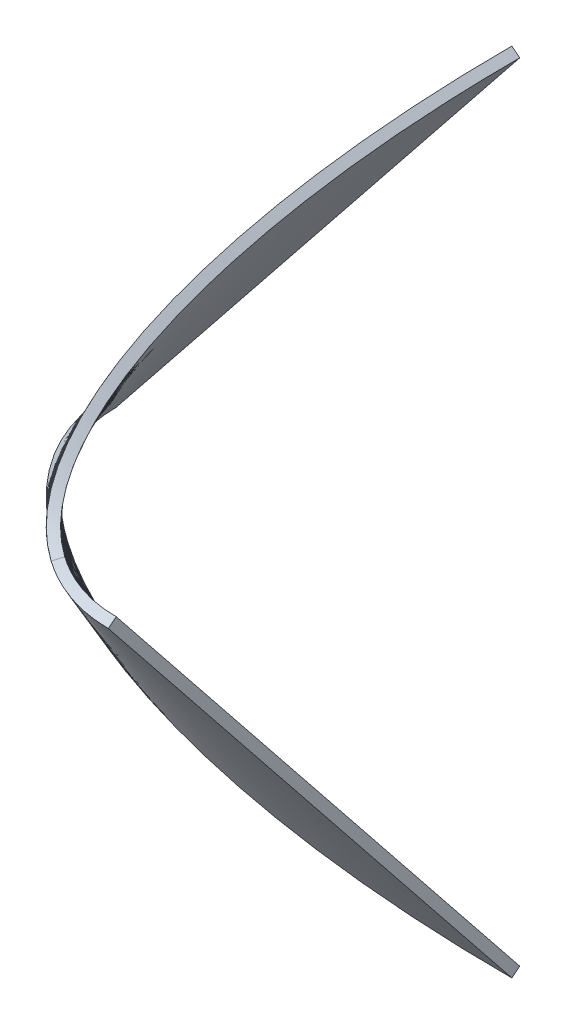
ISO-10303-21;
HEADER;
FILE_DESCRIPTION(('STEP AP214'),'2;1');
FILE_NAME('part.step','',(''),(''),'','','');
FILE_SCHEMA(('AUTOMOTIVE_DESIGN { 1 0 10303 214 1 1 1 1 }'));
ENDSEC;
DATA;
#1=APPLICATION_CONTEXT('core data for automotive mechanical design processes');
#2=APPLICATION_PROTOCOL_DEFINITION('international standard','automotive_design',2000,#1);
#3=PRODUCT_CONTEXT('',#1,'mechanical');
#4=PRODUCT('Part','Part','',(#3));
#5=PRODUCT_RELATED_PRODUCT_CATEGORY('part','',(#4));
#6=PRODUCT_DEFINITION_FORMATION('','',#4);
#7=PRODUCT_DEFINITION_CONTEXT('part definition',#1,'design');
#8=PRODUCT_DEFINITION('design','',#6,#7);
#9=PRODUCT_DEFINITION_SHAPE('','',#8);
#10=(LENGTH_UNIT() NAMED_UNIT(*) SI_UNIT(.MILLI.,.METRE.));
#11=(NAMED_UNIT(*) PLANE_ANGLE_UNIT() SI_UNIT($,.RADIAN.));
#12=(NAMED_UNIT(*) SI_UNIT($,.STERADIAN.) SOLID_ANGLE_UNIT());
#13=UNCERTAINTY_MEASURE_WITH_UNIT(LENGTH_MEASURE(1.E-05),#10,'distance_accuracy_value','');
#14=(GEOMETRIC_REPRESENTATION_CONTEXT(3) GLOBAL_UNCERTAINTY_ASSIGNED_CONTEXT((#13)) GLOBAL_UNIT_ASSIGNED_CONTEXT((#10,
#11,#12)) REPRESENTATION_CONTEXT('',''));
#15=CARTESIAN_POINT('',(0.,0.,0.));
#16=DIRECTION('',(0.,0.,1.));
#17=DIRECTION('',(1.,0.,0.));
#18=AXIS2_PLACEMENT_3D('',#15,#16,#17);
#19=CARTESIAN_POINT('',(-30.,50.,0.));
#20=DIRECTION('',(0.,0.,-1.));
#21=DIRECTION('',(0.780868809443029,-0.624695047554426,0.));
#22=AXIS2_PLACEMENT_3D('',#19,#20,#21);
#23=PLANE('',#22);
#24=CARTESIAN_POINT('',(-29.219131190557,49.3753049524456,0.));
#25=CARTESIAN_POINT('',(-30.,50.,0.));
#26=B_SPLINE_CURVE_WITH_KNOTS('',1,(#24,#25),.UNSPECIFIED.,.F.,.F.,(2,2),(0.,1.),.UNSPECIFIED.);
#27=CARTESIAN_POINT('',(-29.219131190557,49.3753049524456,0.));
#28=VERTEX_POINT('',#27);
#29=CARTESIAN_POINT('',(-30.,50.,0.));
#30=VERTEX_POINT('',#29);
#31=EDGE_CURVE('E14',#28,#30,#26,.T.);
#32=ORIENTED_EDGE('',*,*,#31,.F.);
#33=CARTESIAN_POINT('',(-69.2191311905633,-0.624695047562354,0.));
#34=CARTESIAN_POINT('',(-67.5524645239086,1.458638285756,-2.91055878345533E-10));
#35=CARTESIAN_POINT('',(-65.8857978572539,3.54197161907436,-3.03260839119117E-10));
#36=CARTESIAN_POINT('',(-62.5524645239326,7.70863828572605,-1.49265427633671E-10));
#37=CARTESIAN_POINT('',(-60.8857978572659,9.79197161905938,1.6934944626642E-11));
#38=CARTESIAN_POINT('',(-57.5524645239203,13.9586382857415,1.48427375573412E-10));
#39=CARTESIAN_POINT('',(-55.8857978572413,16.0419716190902,1.13719434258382E-10));
#40=CARTESIAN_POINT('',(-52.5524645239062,20.2086382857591,1.65645079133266E-11));
#41=CARTESIAN_POINT('',(-50.8857978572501,22.2919716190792,-4.5882477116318E-11));
#42=CARTESIAN_POINT('',(-47.5524645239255,26.4586382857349,-6.16065027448E-11));
#43=CARTESIAN_POINT('',(-45.8857978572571,28.5419716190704,-1.48835433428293E-11));
#44=CARTESIAN_POINT('',(-42.5524645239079,32.7086382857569,1.4873899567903E-11));
#45=CARTESIAN_POINT('',(-40.8857978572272,34.7919716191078,-2.09161692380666E-12));
#46=CARTESIAN_POINT('',(-37.5524645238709,38.9586382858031,2.07661549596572E-12));
#47=CARTESIAN_POINT('',(-35.8857978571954,41.0419716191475,2.32103644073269E-11));
#48=CARTESIAN_POINT('',(-32.5524645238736,45.2086382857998,4.72524535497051E-11));
#49=CARTESIAN_POINT('',(-30.8857978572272,47.2919716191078,5.01607937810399E-11));
#50=CARTESIAN_POINT('',(-29.2191311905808,49.3753049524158,1.57940926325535E-11));
#51=B_SPLINE_CURVE_WITH_KNOTS('',3,(#33,#34,#35,#36,#37,#38,#39,#40,#41,#42,#43,#44,#45,#46,#47,
#48,#49,#50),.UNSPECIFIED.,.F.,.F.,(4,2,2,2,2,2,2,2,4),(0.,8.00390529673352,16.0078105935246,
24.0117158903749,32.0156211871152,40.0195264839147,48.0234317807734,56.0273370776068,
64.0312423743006),.UNSPECIFIED.);
#52=CARTESIAN_POINT('',(-69.219131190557,-0.624695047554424,0.));
#53=VERTEX_POINT('',#52);
#54=EDGE_CURVE('E160',#28,#53,#51,.F.);
#55=ORIENTED_EDGE('',*,*,#54,.T.);
#56=CARTESIAN_POINT('',(-70.,0.,0.));
#57=CARTESIAN_POINT('',(-69.219131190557,-0.624695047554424,0.));
#58=B_SPLINE_CURVE_WITH_KNOTS('',1,(#56,#57),.UNSPECIFIED.,.F.,.F.,(2,2),(0.,1.),.UNSPECIFIED.);
#59=CARTESIAN_POINT('',(-70.,0.,0.));
#60=VERTEX_POINT('',#59);
#61=EDGE_CURVE('E119',#53,#60,#58,.F.);
#62=ORIENTED_EDGE('',*,*,#61,.T.);
#63=CARTESIAN_POINT('',(-30.,50.,0.));
#64=CARTESIAN_POINT('',(-70.,0.,0.));
#65=B_SPLINE_CURVE_WITH_KNOTS('',1,(#63,#64),.UNSPECIFIED.,.F.,.F.,(2,2),(0.,1.),.UNSPECIFIED.);
#66=EDGE_CURVE('E163',#30,#60,#65,.T.);
#67=ORIENTED_EDGE('',*,*,#66,.F.);
#68=EDGE_LOOP('',(#32,#55,#62,#67));
#69=FACE_BOUND('',#68,.T.);
#70=ADVANCED_FACE('F107',(#69),#23,.T.);
#71=CARTESIAN_POINT('',(-59.7044158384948,0.,15.6612381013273));
#72=CARTESIAN_POINT('',(-60.4888896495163,0.,15.111943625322));
#73=CARTESIAN_POINT('',(-61.0596221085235,0.,14.6779794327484));
#74=CARTESIAN_POINT('',(-62.080263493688,0.,13.867225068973));
#75=CARTESIAN_POINT('',(-62.5301724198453,0.,13.4904348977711));
#76=CARTESIAN_POINT('',(-63.3451650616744,0.,12.7737515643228));
#77=CARTESIAN_POINT('',(-63.7102487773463,0.,12.4338584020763));
#78=CARTESIAN_POINT('',(-64.3929645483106,0.,11.7695858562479));
#79=CARTESIAN_POINT('',(-64.7105966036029,0.,11.4452064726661));
#80=CARTESIAN_POINT('',(-65.3046055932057,0.,10.8081184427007));
#81=CARTESIAN_POINT('',(-65.5809825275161,0.,10.4954097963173));
#82=CARTESIAN_POINT('',(-66.1031180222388,0.,9.87519194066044));
#83=CARTESIAN_POINT('',(-66.348876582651,0.,9.56768273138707));
#84=CARTESIAN_POINT('',(-67.0440158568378,0.,8.65006665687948));
#85=CARTESIAN_POINT('',(-67.4524452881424,0.,8.04419907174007));
#86=CARTESIAN_POINT('',(-68.1776116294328,0.,6.82974414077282));
#87=CARTESIAN_POINT('',(-68.4935819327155,0.,6.22156521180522));
#88=CARTESIAN_POINT('',(-69.0373891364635,0.,4.99714063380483));
#89=CARTESIAN_POINT('',(-69.2649292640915,0.,4.3810591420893));
#90=CARTESIAN_POINT('',(-69.8136949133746,0.,2.51967204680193));
#91=CARTESIAN_POINT('',(-70.,0.,1.26099894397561));
#92=CARTESIAN_POINT('',(-70.,0.,0.));
#93=CARTESIAN_POINT('',(-59.1487392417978,0.247872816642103,14.8676496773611));
#94=CARTESIAN_POINT('',(-59.9144584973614,0.222464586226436,14.323551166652));
#95=CARTESIAN_POINT('',(-60.4605169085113,0.187718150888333,13.8991378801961));
#96=CARTESIAN_POINT('',(-61.4524521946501,0.14254704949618,13.1015275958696));
#97=CARTESIAN_POINT('',(-61.8870946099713,0.116812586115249,12.7329191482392));
#98=CARTESIAN_POINT('',(-62.6728776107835,0.063200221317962,12.0354699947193));
#99=CARTESIAN_POINT('',(-63.0241322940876,0.0354490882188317,11.706642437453));
#100=CARTESIAN_POINT('',(-63.6844397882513,-0.0143109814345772,11.0634389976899));
#101=CARTESIAN_POINT('',(-63.9910986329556,-0.0407350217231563,10.751166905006));
#102=CARTESIAN_POINT('',(-64.5646717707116,-0.0950093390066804,10.1414110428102));
#103=CARTESIAN_POINT('',(-64.8319557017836,-0.122086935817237,9.84349423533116));
#104=CARTESIAN_POINT('',(-65.3389305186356,-0.173430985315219,9.25319559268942));
#105=CARTESIAN_POINT('',(-65.577933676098,-0.19938586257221,8.96197866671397));
#106=CARTESIAN_POINT('',(-66.2558645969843,-0.275977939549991,8.09635718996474));
#107=CARTESIAN_POINT('',(-66.6574146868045,-0.323732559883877,7.5278805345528));
#108=CARTESIAN_POINT('',(-67.3754435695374,-0.410705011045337,6.39235523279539));
#109=CARTESIAN_POINT('',(-67.6912827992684,-0.449222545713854,5.82498944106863));
#110=CARTESIAN_POINT('',(-68.2382454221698,-0.514882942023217,4.68246299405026));
#111=CARTESIAN_POINT('',(-68.4690275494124,-0.541877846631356,4.10723509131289));
#112=CARTESIAN_POINT('',(-69.0274886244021,-0.605494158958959,2.3662461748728));
#113=CARTESIAN_POINT('',(-69.219131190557,-0.624695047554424,1.18462776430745));
#114=CARTESIAN_POINT('',(-69.219131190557,-0.624695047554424,0.));
#115=B_SPLINE_SURFACE_WITH_KNOTS('',1,3,((#71,#72,#73,#74,#75,#76,#77,#78,#79,#80,#81,#82,#83,
#84,#85,#86,#87,#88,#89,#90,#91,#92),(#93,#94,#95,#96,#97,#98,#99,#100,#101,#102,#103,#104,#105,
#106,#107,#108,#109,#110,#111,#112,#113,#114)),.UNSPECIFIED.,.F.,.F.,.F.,(2,2),(4,2,2,2,2,2,2,2,
2,2,4),(0.,1.),(0.,0.0625,0.125,0.1875,0.25,0.3125,0.375,0.5,0.625,0.75,1.),.UNSPECIFIED.);
#116=CARTESIAN_POINT('',(-69.219131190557,-0.624695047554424,0.));
#117=CARTESIAN_POINT('',(-69.219131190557,-0.624695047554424,1.18462776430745));
#118=CARTESIAN_POINT('',(-69.0274886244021,-0.605494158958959,2.3662461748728));
#119=CARTESIAN_POINT('',(-68.4690275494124,-0.541877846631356,4.10723509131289));
#120=CARTESIAN_POINT('',(-68.2382454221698,-0.514882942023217,4.68246299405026));
#121=CARTESIAN_POINT('',(-67.6912827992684,-0.449222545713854,5.82498944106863));
#122=CARTESIAN_POINT('',(-67.3754435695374,-0.410705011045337,6.39235523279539));
#123=CARTESIAN_POINT('',(-66.6574146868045,-0.323732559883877,7.5278805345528));
#124=CARTESIAN_POINT('',(-66.2558645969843,-0.275977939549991,8.09635718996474));
#125=CARTESIAN_POINT('',(-65.577933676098,-0.19938586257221,8.96197866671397));
#126=CARTESIAN_POINT('',(-65.3389305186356,-0.173430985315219,9.25319559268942));
#127=CARTESIAN_POINT('',(-64.8319557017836,-0.122086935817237,9.84349423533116));
#128=CARTESIAN_POINT('',(-64.5646717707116,-0.0950093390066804,10.1414110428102));
#129=CARTESIAN_POINT('',(-63.9910986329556,-0.0407350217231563,10.751166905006));
#130=CARTESIAN_POINT('',(-63.6844397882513,-0.0143109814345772,11.0634389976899));
#131=CARTESIAN_POINT('',(-63.0241322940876,0.0354490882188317,11.706642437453));
#132=CARTESIAN_POINT('',(-62.6728776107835,0.063200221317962,12.0354699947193));
#133=CARTESIAN_POINT('',(-61.8870946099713,0.116812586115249,12.7329191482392));
#134=CARTESIAN_POINT('',(-61.4524521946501,0.14254704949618,13.1015275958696));
#135=CARTESIAN_POINT('',(-60.4605169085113,0.187718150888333,13.8991378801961));
#136=CARTESIAN_POINT('',(-59.9144584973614,0.222464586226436,14.323551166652));
#137=CARTESIAN_POINT('',(-59.1487392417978,0.247872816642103,14.8676496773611));
#138=B_SPLINE_CURVE_WITH_KNOTS('',3,(#116,#117,#118,#119,#120,#121,#122,#123,#124,#125,#126,
#127,#128,#129,#130,#131,#132,#133,#134,#135,#136,#137),.UNSPECIFIED.,.F.,.F.,(4,2,2,2,2,2,2,2,
2,2,4),(0.,0.25,0.375,0.5,0.625,0.6875,0.75,0.8125,0.875,0.9375,1.),.UNSPECIFIED.);
#139=CARTESIAN_POINT('',(-59.1487392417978,0.247872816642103,14.8676496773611));
#140=VERTEX_POINT('',#139);
#141=EDGE_CURVE('E182',#53,#140,#138,.T.);
#142=CARTESIAN_POINT('',(-59.1487392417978,0.247872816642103,14.8676496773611));
#143=CARTESIAN_POINT('',(-59.7044158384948,0.,15.6612381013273));
#144=B_SPLINE_CURVE_WITH_KNOTS('',1,(#142,#143),.UNSPECIFIED.,.F.,.F.,(2,2),(0.,1.),.UNSPECIFIED.);
#145=CARTESIAN_POINT('',(-59.7044158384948,0.,15.6612381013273));
#146=VERTEX_POINT('',#145);
#147=EDGE_CURVE('E300',#140,#146,#144,.T.);
#148=CARTESIAN_POINT('',(-70.,0.,0.));
#149=CARTESIAN_POINT('',(-70.,0.,0.630217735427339));
#150=CARTESIAN_POINT('',(-69.9071368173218,0.,1.89064733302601));
#151=CARTESIAN_POINT('',(-69.5616820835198,0.,3.45250618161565));
#152=CARTESIAN_POINT('',(-69.1510983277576,0.,4.68914973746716));
#153=CARTESIAN_POINT('',(-68.7766068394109,0.,5.61029529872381));
#154=CARTESIAN_POINT('',(-68.3353875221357,0.,6.52578660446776));
#155=CARTESIAN_POINT('',(-67.8267863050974,0.,7.43714350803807));
#156=CARTESIAN_POINT('',(-67.2476380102,0.,8.34746900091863));
#157=CARTESIAN_POINT('',(-66.5946351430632,0.,9.26017352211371));
#158=CARTESIAN_POINT('',(-65.8573594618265,0.,10.1827011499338));
#159=CARTESIAN_POINT('',(-65.0282286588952,0.,11.1208270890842));
#160=CARTESIAN_POINT('',(-64.0753324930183,0.,12.0939652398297));
#161=CARTESIAN_POINT('',(-62.9800813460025,0.,13.1136447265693));
#162=CARTESIAN_POINT('',(-61.6303545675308,0.,14.2440152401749));
#163=CARTESIAN_POINT('',(-60.4888896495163,0.,15.111943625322));
#164=CARTESIAN_POINT('',(-59.7044158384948,0.,15.6612381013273));
#165=B_SPLINE_CURVE_WITH_KNOTS('',3,(#148,#149,#150,#151,#152,#153,#154,#155,#156,#157,#158,
#159,#160,#161,#162,#163,#164),.UNSPECIFIED.,.F.,.F.,(4,1,1,1,1,1,1,1,1,1,1,1,1,1,4),(0.,0.125,
0.25,0.3125,0.375,0.4375,0.5,0.5625,0.625,0.6875,0.75,0.8125,0.875,0.9375,1.),.UNSPECIFIED.);
#166=EDGE_CURVE('E327',#60,#146,#165,.T.);
#167=ORIENTED_EDGE('',*,*,#61,.F.);
#168=ORIENTED_EDGE('',*,*,#141,.T.);
#169=ORIENTED_EDGE('',*,*,#147,.T.);
#170=ORIENTED_EDGE('',*,*,#166,.F.);
#171=EDGE_LOOP('',(#167,#168,#169,#170));
#172=FACE_BOUND('',#171,.T.);
#173=ADVANCED_FACE('F218',(#172),#115,.F.);
#174=CARTESIAN_POINT('',(0.,0.,30.));
#175=CARTESIAN_POINT('',(-3.14476097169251,0.,30.));
#176=CARTESIAN_POINT('',(-6.53050049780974,0.,29.9084277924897));
#177=CARTESIAN_POINT('',(-13.4923244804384,0.,29.4758080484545));
#178=CARTESIAN_POINT('',(-17.0684089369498,0.,29.1347605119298));
#179=CARTESIAN_POINT('',(-23.9042068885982,0.,28.2394800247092));
#180=CARTESIAN_POINT('',(-27.1639203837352,0.,27.6852470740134));
#181=CARTESIAN_POINT('',(-33.1607406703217,0.,26.4587521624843));
#182=CARTESIAN_POINT('',(-35.8978474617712,0.,25.7864902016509));
#183=CARTESIAN_POINT('',(-40.8994024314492,0.,24.3802696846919));
#184=CARTESIAN_POINT('',(-43.1638506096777,0.,23.6463111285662));
#185=CARTESIAN_POINT('',(-47.3122605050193,0.,22.1406354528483));
#186=CARTESIAN_POINT('',(-49.1962222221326,0.,21.368918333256));
#187=CARTESIAN_POINT('',(-52.6614461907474,0.,19.7938899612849));
#188=CARTESIAN_POINT('',(-54.2427084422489,0.,18.9905787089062));
#189=CARTESIAN_POINT('',(-57.1541597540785,0.,17.3514028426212));
#190=CARTESIAN_POINT('',(-58.4843485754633,0.,16.5155383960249));
#191=CARTESIAN_POINT('',(-59.7044158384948,0.,15.6612381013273));
#192=CARTESIAN_POINT('',(0.,0.624695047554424,29.219131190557));
#193=CARTESIAN_POINT('',(-3.12960056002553,0.624695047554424,29.219131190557));
#194=CARTESIAN_POINT('',(-6.499752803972,0.623742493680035,29.1271940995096));
#195=CARTESIAN_POINT('',(-13.4258638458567,0.618640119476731,28.6927412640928));
#196=CARTESIAN_POINT('',(-16.9852078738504,0.615058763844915,28.35040766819));
#197=CARTESIAN_POINT('',(-23.7814482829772,0.603373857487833,27.451254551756));
#198=CARTESIAN_POINT('',(-27.0220810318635,0.596292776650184,26.8947922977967));
#199=CARTESIAN_POINT('',(-32.9782080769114,0.578202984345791,25.6632237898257));
#200=CARTESIAN_POINT('',(-35.6941727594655,0.567317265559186,24.9881811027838));
#201=CARTESIAN_POINT('',(-40.6526703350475,0.542097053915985,23.5766007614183));
#202=CARTESIAN_POINT('',(-42.894020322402,0.527047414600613,22.8399165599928));
#203=CARTESIAN_POINT('',(-46.9951031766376,0.49271913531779,21.3297725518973));
#204=CARTESIAN_POINT('',(-48.8532794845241,0.472308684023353,20.5561525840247));
#205=CARTESIAN_POINT('',(-52.2648405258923,0.425283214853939,18.979573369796));
#206=CARTESIAN_POINT('',(-53.8167045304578,0.397336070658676,18.1765354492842));
#207=CARTESIAN_POINT('',(-56.6665435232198,0.332050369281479,16.5427034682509));
#208=CARTESIAN_POINT('',(-57.963180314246,0.29330415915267,15.7119771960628));
#209=CARTESIAN_POINT('',(-59.1487392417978,0.247872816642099,14.8676496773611));
#210=B_SPLINE_SURFACE_WITH_KNOTS('',1,3,((#174,#175,#176,#177,#178,#179,#180,#181,#182,#183,
#184,#185,#186,#187,#188,#189,#190,#191),(#192,#193,#194,#195,#196,#197,#198,#199,#200,#201,
#202,#203,#204,#205,#206,#207,#208,#209)),.UNSPECIFIED.,.F.,.F.,.F.,(2,2),(4,2,2,2,2,2,2,2,4),
(0.,1.),(0.,0.125,0.25,0.375,0.5,0.625,0.75,0.875,1.),.UNSPECIFIED.);
#211=CARTESIAN_POINT('',(-59.1487392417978,0.247872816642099,14.8676496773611));
#212=CARTESIAN_POINT('',(-57.963180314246,0.29330415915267,15.7119771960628));
#213=CARTESIAN_POINT('',(-56.6665435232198,0.332050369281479,16.5427034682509));
#214=CARTESIAN_POINT('',(-53.8167045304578,0.397336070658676,18.1765354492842));
#215=CARTESIAN_POINT('',(-52.2648405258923,0.425283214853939,18.979573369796));
#216=CARTESIAN_POINT('',(-48.8532794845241,0.472308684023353,20.5561525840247));
#217=CARTESIAN_POINT('',(-46.9951031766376,0.49271913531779,21.3297725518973));
#218=CARTESIAN_POINT('',(-42.894020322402,0.527047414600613,22.8399165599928));
#219=CARTESIAN_POINT('',(-40.6526703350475,0.542097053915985,23.5766007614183));
#220=CARTESIAN_POINT('',(-35.6941727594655,0.567317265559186,24.9881811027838));
#221=CARTESIAN_POINT('',(-32.9782080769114,0.578202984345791,25.6632237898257));
#222=CARTESIAN_POINT('',(-27.0220810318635,0.596292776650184,26.8947922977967));
#223=CARTESIAN_POINT('',(-23.7814482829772,0.603373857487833,27.451254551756));
#224=CARTESIAN_POINT('',(-16.9852078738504,0.615058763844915,28.35040766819));
#225=CARTESIAN_POINT('',(-13.4258638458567,0.618640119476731,28.6927412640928));
#226=CARTESIAN_POINT('',(-6.499752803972,0.623742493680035,29.1271940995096));
#227=CARTESIAN_POINT('',(-3.12960056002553,0.624695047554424,29.219131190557));
#228=CARTESIAN_POINT('',(0.,0.624695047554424,29.219131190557));
#229=B_SPLINE_CURVE_WITH_KNOTS('',3,(#211,#212,#213,#214,#215,#216,#217,#218,#219,#220,#221,
#222,#223,#224,#225,#226,#227,#228),.UNSPECIFIED.,.F.,.F.,(4,2,2,2,2,2,2,2,4),(0.,0.125,0.25,
0.375,0.5,0.625,0.75,0.875,1.),.UNSPECIFIED.);
#230=CARTESIAN_POINT('',(0.,0.624695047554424,29.219131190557));
#231=VERTEX_POINT('',#230);
#232=EDGE_CURVE('E434',#140,#231,#229,.T.);
#233=CARTESIAN_POINT('',(0.,0.624695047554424,29.219131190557));
#234=CARTESIAN_POINT('',(0.,0.,30.));
#235=B_SPLINE_CURVE_WITH_KNOTS('',1,(#233,#234),.UNSPECIFIED.,.F.,.F.,(2,2),(0.,1.),.UNSPECIFIED.);
#236=CARTESIAN_POINT('',(0.,0.,30.));
#237=VERTEX_POINT('',#236);
#238=EDGE_CURVE('E127',#231,#237,#235,.T.);
#239=CARTESIAN_POINT('',(-59.7044158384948,0.,15.6612381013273));
#240=CARTESIAN_POINT('',(-59.3993988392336,0.,15.8748133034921));
#241=CARTESIAN_POINT('',(-58.7756001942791,0.,16.2996588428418));
#242=CARTESIAN_POINT('',(-57.4710149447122,0.,17.1404021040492));
#243=CARTESIAN_POINT('',(-55.7298182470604,0.,18.1750599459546));
#244=CARTESIAN_POINT('',(-53.4520773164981,0.,19.3922343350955));
#245=CARTESIAN_POINT('',(-50.9666716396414,0.,20.5853534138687));
#246=CARTESIAN_POINT('',(-48.254241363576,0.,21.7547768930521));
#247=CARTESIAN_POINT('',(-45.2856163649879,0.,22.8981931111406));
#248=CARTESIAN_POINT('',(-42.0316265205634,0.,24.0132904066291));
#249=CARTESIAN_POINT('',(-38.4577072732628,0.,25.0910920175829));
#250=CARTESIAN_POINT('',(-34.5292940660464,0.,26.1226211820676));
#251=CARTESIAN_POINT('',(-30.2276563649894,0.,27.086753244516));
#252=CARTESIAN_POINT('',(-25.5340636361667,0.,27.9623635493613));
#253=CARTESIAN_POINT('',(-20.5258542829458,0.,28.7137684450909));
#254=CARTESIAN_POINT('',(-15.2803667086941,0.,29.3052842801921));
#255=CARTESIAN_POINT('',(-8.22337026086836,0.,29.8626416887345));
#256=CARTESIAN_POINT('',(-3.1447609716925,0.,30.));
#257=CARTESIAN_POINT('',(0.,0.,30.));
#258=B_SPLINE_CURVE_WITH_KNOTS('',3,(#239,#240,#241,#242,#243,#244,#245,#246,#247,#248,#249,
#250,#251,#252,#253,#254,#255,#256,#257),.UNSPECIFIED.,.F.,.F.,(4,1,1,1,1,1,1,1,1,1,1,1,1,1,1,1,
4),(0.,0.03125,0.0624999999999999,0.125,0.1875,0.25,0.3125,0.375,0.4375,0.5,0.5625,0.625,0.6875,
0.75,0.8125,0.875,1.),.UNSPECIFIED.);
#259=EDGE_CURVE('E348',#146,#237,#258,.T.);
#260=ORIENTED_EDGE('',*,*,#147,.F.);
#261=ORIENTED_EDGE('',*,*,#232,.T.);
#262=ORIENTED_EDGE('',*,*,#238,.T.);
#263=ORIENTED_EDGE('',*,*,#259,.F.);
#264=EDGE_LOOP('',(#260,#261,#262,#263));
#265=FACE_BOUND('',#264,.T.);
#266=ADVANCED_FACE('F260',(#265),#210,.F.);
#267=CARTESIAN_POINT('',(0.,0.,30.));
#268=DIRECTION('',(1.,0.,0.));
#269=DIRECTION('',(0.,0.624695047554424,-0.78086880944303));
#270=AXIS2_PLACEMENT_3D('',#267,#268,#269);
#271=PLANE('',#270);
#272=ORIENTED_EDGE('',*,*,#238,.F.);
#273=CARTESIAN_POINT('',(-8.01829857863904E-10,50.6246950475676,69.2191311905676));
#274=CARTESIAN_POINT('',(-2.22904913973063E-10,48.5413617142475,67.5524645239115));
#275=CARTESIAN_POINT('',(-3.52015756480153E-11,46.4580283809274,65.8857978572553));
#276=CARTESIAN_POINT('',(3.52014225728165E-11,42.2913617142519,62.552464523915));
#277=CARTESIAN_POINT('',(-8.20989175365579E-11,40.2080283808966,60.8857978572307));
#278=CARTESIAN_POINT('',(-1.44263743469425E-10,36.0413617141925,57.5524645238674));
#279=CARTESIAN_POINT('',(-8.9128229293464E-11,33.9580283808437,55.8857978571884));
#280=CARTESIAN_POINT('',(-7.74564415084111E-11,29.7913617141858,52.5524645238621));
#281=CARTESIAN_POINT('',(-1.20920167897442E-10,27.7080283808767,50.8857978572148));
#282=CARTESIAN_POINT('',(-1.42646033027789E-10,23.5413617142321,47.5524645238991));
#283=CARTESIAN_POINT('',(-1.20908171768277E-10,21.4580283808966,45.8857978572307));
#284=CARTESIAN_POINT('',(-9.71114563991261E-11,17.2913617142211,42.5524645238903));
#285=CARTESIAN_POINT('',(-9.50526022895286E-11,15.2080283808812,40.8857978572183));
#286=CARTESIAN_POINT('',(-9.084278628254E-11,11.0413617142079,37.5524645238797));
#287=CARTESIAN_POINT('',(-8.86918243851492E-11,8.95802838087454,35.8857978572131));
#288=CARTESIAN_POINT('',(-7.33304093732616E-11,4.79136171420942,32.552464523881));
#289=CARTESIAN_POINT('',(-6.01199562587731E-11,2.70802838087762,30.8857978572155));
#290=CARTESIAN_POINT('',(-3.58960658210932E-11,0.624695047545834,29.2191311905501));
#291=B_SPLINE_CURVE_WITH_KNOTS('',3,(#273,#274,#275,#276,#277,#278,#279,#280,#281,#282,#283,
#284,#285,#286,#287,#288,#289,#290),.UNSPECIFIED.,.F.,.F.,(4,2,2,2,2,2,2,2,4),(0.,
8.00390529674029,16.007810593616,24.0117158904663,32.0156211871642,40.0195264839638,
48.0234317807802,56.0273370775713,64.0312423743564),.UNSPECIFIED.);
#292=CARTESIAN_POINT('',(0.,50.6246950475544,69.219131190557));
#293=VERTEX_POINT('',#292);
#294=EDGE_CURVE('E193',#231,#293,#291,.F.);
#295=ORIENTED_EDGE('',*,*,#294,.T.);
#296=CARTESIAN_POINT('',(0.,50.,70.));
#297=CARTESIAN_POINT('',(0.,50.6246950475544,69.219131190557));
#298=B_SPLINE_CURVE_WITH_KNOTS('',1,(#296,#297),.UNSPECIFIED.,.F.,.F.,(2,2),(0.,1.),.UNSPECIFIED.);
#299=CARTESIAN_POINT('',(0.,50.,70.));
#300=VERTEX_POINT('',#299);
#301=EDGE_CURVE('E330',#293,#300,#298,.F.);
#302=ORIENTED_EDGE('',*,*,#301,.T.);
#303=CARTESIAN_POINT('',(0.,0.,30.));
#304=CARTESIAN_POINT('',(0.,50.,70.));
#305=B_SPLINE_CURVE_WITH_KNOTS('',1,(#303,#304),.UNSPECIFIED.,.F.,.F.,(2,2),(0.,1.),.UNSPECIFIED.);
#306=EDGE_CURVE('E353',#237,#300,#305,.T.);
#307=ORIENTED_EDGE('',*,*,#306,.F.);
#308=EDGE_LOOP('',(#272,#295,#302,#307));
#309=FACE_BOUND('',#308,.T.);
#310=ADVANCED_FACE('F109',(#309),#271,.T.);
#311=CARTESIAN_POINT('',(0.,50.,70.));
#312=CARTESIAN_POINT('',(-0.563225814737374,50.,70.));
#313=CARTESIAN_POINT('',(-1.12602610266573,50.0000000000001,69.963531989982));
#314=CARTESIAN_POINT('',(-2.27406995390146,50.,69.8114923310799));
#315=CARTESIAN_POINT('',(-2.85839262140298,50.,69.6964650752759));
#316=CARTESIAN_POINT('',(-3.78120915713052,50.,69.4455263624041));
#317=CARTESIAN_POINT('',(-4.09702385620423,50.,69.3484010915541));
#318=CARTESIAN_POINT('',(-4.75543783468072,50.,69.1193518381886));
#319=CARTESIAN_POINT('',(-5.0988173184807,50.,68.9868305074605));
#320=CARTESIAN_POINT('',(-5.65173816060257,50.0000000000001,68.7479567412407));
#321=CARTESIAN_POINT('',(-5.84207973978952,50.,68.661858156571));
#322=CARTESIAN_POINT('',(-6.24658587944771,50.,68.4674589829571));
#323=CARTESIAN_POINT('',(-6.46075043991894,50.,68.3591583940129));
#324=CARTESIAN_POINT('',(-6.91990787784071,50.,68.1146766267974));
#325=CARTESIAN_POINT('',(-7.16490075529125,50.0000000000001,67.9784954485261));
#326=CARTESIAN_POINT('',(-7.60748578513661,50.,67.7125371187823));
#327=CARTESIAN_POINT('',(-7.76753008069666,50.,67.6136032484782));
#328=CARTESIAN_POINT('',(-8.03388430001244,50.,67.4438170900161));
#329=CARTESIAN_POINT('',(-8.12705033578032,50.,67.383657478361));
#330=CARTESIAN_POINT('',(-8.34524426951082,50.,67.2382421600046));
#331=CARTESIAN_POINT('',(-8.47027216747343,50.,67.1529864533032));
#332=CARTESIAN_POINT('',(-8.62278063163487,50.,67.0461988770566));
#333=CARTESIAN_POINT('',(0.,50.6246950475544,69.219131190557));
#334=CARTESIAN_POINT('',(-0.529104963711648,50.6246950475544,69.219131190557));
#335=CARTESIAN_POINT('',(-1.05750810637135,50.6195137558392,69.1806507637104));
#336=CARTESIAN_POINT('',(-2.13429559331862,50.5982293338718,69.0215684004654));
#337=CARTESIAN_POINT('',(-2.68069460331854,50.5818276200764,68.9014647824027));
#338=CARTESIAN_POINT('',(-3.54374683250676,50.5478532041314,68.6430303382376));
#339=CARTESIAN_POINT('',(-3.83755091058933,50.5339298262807,68.5432442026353));
#340=CARTESIAN_POINT('',(-4.45320747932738,50.5040537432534,68.3098634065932));
#341=CARTESIAN_POINT('',(-4.77090725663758,50.4843905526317,68.1751917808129));
#342=CARTESIAN_POINT('',(-5.28902217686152,50.4552642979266,67.9346912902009));
#343=CARTESIAN_POINT('',(-5.4654376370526,50.4431412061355,67.8481306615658));
#344=CARTESIAN_POINT('',(-5.84102739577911,50.4165484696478,67.6535821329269));
#345=CARTESIAN_POINT('',(-6.04109763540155,50.4029422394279,67.5455995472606));
#346=CARTESIAN_POINT('',(-6.47390740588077,50.3764909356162,67.3024654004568));
#347=CARTESIAN_POINT('',(-6.69793682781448,50.3544391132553,67.1678693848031));
#348=CARTESIAN_POINT('',(-7.11255619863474,50.3228651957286,66.9056901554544));
#349=CARTESIAN_POINT('',(-7.26346874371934,50.3122293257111,66.8082430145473));
#350=CARTESIAN_POINT('',(-7.51735313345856,50.2973401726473,66.6408059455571));
#351=CARTESIAN_POINT('',(-7.60238441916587,50.2874771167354,66.5822475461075));
#352=CARTESIAN_POINT('',(-7.80423537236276,50.2669894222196,66.4406198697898));
#353=CARTESIAN_POINT('',(-7.9211435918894,50.2565870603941,66.3575348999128));
#354=CARTESIAN_POINT('',(-8.06710403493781,50.2478728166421,66.2526104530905));
#355=B_SPLINE_SURFACE_WITH_KNOTS('',1,3,((#311,#312,#313,#314,#315,#316,#317,#318,#319,#320,
#321,#322,#323,#324,#325,#326,#327,#328,#329,#330,#331,#332),(#333,#334,#335,#336,#337,#338,
#339,#340,#341,#342,#343,#344,#345,#346,#347,#348,#349,#350,#351,#352,#353,#354)),.UNSPECIFIED.,
.F.,.F.,.F.,(2,2),(4,2,2,2,2,2,2,2,2,2,4),(0.,1.),(0.,0.25,0.5,0.625,0.75,0.8125,0.875,0.9375,
0.96875,0.984375,1.),.UNSPECIFIED.);
#356=CARTESIAN_POINT('',(0.,50.6246950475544,69.219131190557));
#357=CARTESIAN_POINT('',(-0.529104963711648,50.6246950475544,69.219131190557));
#358=CARTESIAN_POINT('',(-1.05750810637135,50.6195137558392,69.1806507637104));
#359=CARTESIAN_POINT('',(-2.13429559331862,50.5982293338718,69.0215684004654));
#360=CARTESIAN_POINT('',(-2.68069460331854,50.5818276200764,68.9014647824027));
#361=CARTESIAN_POINT('',(-3.54374683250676,50.5478532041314,68.6430303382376));
#362=CARTESIAN_POINT('',(-3.83755091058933,50.5339298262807,68.5432442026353));
#363=CARTESIAN_POINT('',(-4.45320747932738,50.5040537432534,68.3098634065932));
#364=CARTESIAN_POINT('',(-4.77090725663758,50.4843905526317,68.1751917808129));
#365=CARTESIAN_POINT('',(-5.28902217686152,50.4552642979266,67.9346912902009));
#366=CARTESIAN_POINT('',(-5.4654376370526,50.4431412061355,67.8481306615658));
#367=CARTESIAN_POINT('',(-5.84102739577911,50.4165484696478,67.6535821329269));
#368=CARTESIAN_POINT('',(-6.04109763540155,50.4029422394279,67.5455995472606));
#369=CARTESIAN_POINT('',(-6.47390740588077,50.3764909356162,67.3024654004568));
#370=CARTESIAN_POINT('',(-6.69793682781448,50.3544391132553,67.1678693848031));
#371=CARTESIAN_POINT('',(-7.11255619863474,50.3228651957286,66.9056901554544));
#372=CARTESIAN_POINT('',(-7.26346874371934,50.3122293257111,66.8082430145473));
#373=CARTESIAN_POINT('',(-7.51735313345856,50.2973401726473,66.6408059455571));
#374=CARTESIAN_POINT('',(-7.60238441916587,50.2874771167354,66.5822475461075));
#375=CARTESIAN_POINT('',(-7.80423537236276,50.2669894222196,66.4406198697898));
#376=CARTESIAN_POINT('',(-7.9211435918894,50.2565870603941,66.3575348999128));
#377=CARTESIAN_POINT('',(-8.06710403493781,50.2478728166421,66.2526104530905));
#378=B_SPLINE_CURVE_WITH_KNOTS('',3,(#356,#357,#358,#359,#360,#361,#362,#363,#364,#365,#366,
#367,#368,#369,#370,#371,#372,#373,#374,#375,#376,#377),.UNSPECIFIED.,.F.,.F.,(4,2,2,2,2,2,2,2,
2,2,4),(0.,0.25,0.5,0.625,0.75,0.8125,0.875,0.9375,0.96875,0.984375,1.),.UNSPECIFIED.);
#379=CARTESIAN_POINT('',(-8.06710403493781,50.2478728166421,66.2526104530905));
#380=VERTEX_POINT('',#379);
#381=EDGE_CURVE('E365',#293,#380,#378,.T.);
#382=CARTESIAN_POINT('',(-8.06710403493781,50.2478728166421,66.2526104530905));
#383=CARTESIAN_POINT('',(-8.62278063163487,50.,67.0461988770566));
#384=B_SPLINE_CURVE_WITH_KNOTS('',1,(#382,#383),.UNSPECIFIED.,.F.,.F.,(2,2),(0.,1.),.UNSPECIFIED.);
#385=CARTESIAN_POINT('',(-8.62278063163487,50.,67.0461988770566));
#386=VERTEX_POINT('',#385);
#387=EDGE_CURVE('E190',#380,#386,#384,.T.);
#388=CARTESIAN_POINT('',(0.,50.,70.));
#389=CARTESIAN_POINT('',(-0.28156252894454,50.,70.));
#390=CARTESIAN_POINT('',(-0.70389846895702,50.,69.9861686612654));
#391=CARTESIAN_POINT('',(-1.27095358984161,50.,69.9395263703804));
#392=CARTESIAN_POINT('',(-1.69933702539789,50.,69.8900124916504));
#393=CARTESIAN_POINT('',(-2.1319864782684,49.9999999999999,69.8254966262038));
#394=CARTESIAN_POINT('',(-2.57041510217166,50.0000000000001,69.7451270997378));
#395=CARTESIAN_POINT('',(-3.01614213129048,49.9999999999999,69.6480196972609));
#396=CARTESIAN_POINT('',(-3.47163026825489,50.0000000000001,69.5324837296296));
#397=CARTESIAN_POINT('',(-3.93895866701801,49.9999999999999,69.3970809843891));
#398=CARTESIAN_POINT('',(-4.42296169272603,50.0000000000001,69.2381676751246));
#399=CARTESIAN_POINT('',(-4.92657963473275,49.9999999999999,69.053507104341));
#400=CARTESIAN_POINT('',(-5.46139658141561,50.0000000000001,68.8340553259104));
#401=CARTESIAN_POINT('',(-6.03242131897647,50.,68.5757595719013));
#402=CARTESIAN_POINT('',(-6.67491500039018,49.9999999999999,68.2508578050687));
#403=CARTESIAN_POINT('',(-7.28739719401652,50.0000000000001,67.9104048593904));
#404=CARTESIAN_POINT('',(-7.92757437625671,50.,67.5146693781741));
#405=CARTESIAN_POINT('',(-8.31776370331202,50.,67.2597740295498));
#406=CARTESIAN_POINT('',(-8.62278063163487,50.,67.0461988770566));
#407=B_SPLINE_CURVE_WITH_KNOTS('',3,(#388,#389,#390,#391,#392,#393,#394,#395,#396,#397,#398,
#399,#400,#401,#402,#403,#404,#405,#406),.UNSPECIFIED.,.F.,.F.,(4,1,1,1,1,1,1,1,1,1,1,1,1,1,1,1,
4),(0.,0.125,0.1875,0.25,0.3125,0.375,0.4375,0.5,0.5625,0.625,0.6875,0.75,0.8125,0.875,0.9375,
0.96875,1.),.UNSPECIFIED.);
#408=EDGE_CURVE('E336',#300,#386,#407,.T.);
#409=ORIENTED_EDGE('',*,*,#301,.F.);
#410=ORIENTED_EDGE('',*,*,#381,.T.);
#411=ORIENTED_EDGE('',*,*,#387,.T.);
#412=ORIENTED_EDGE('',*,*,#408,.F.);
#413=EDGE_LOOP('',(#409,#410,#411,#412));
#414=FACE_BOUND('',#413,.T.);
#415=ADVANCED_FACE('F215',(#414),#355,.T.);
#416=CARTESIAN_POINT('',(-8.62278063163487,50.,67.0461988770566));
#417=CARTESIAN_POINT('',(-9.40725426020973,50.,66.4969045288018));
#418=CARTESIAN_POINT('',(-10.1722337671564,50.,65.8796350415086));
#419=CARTESIAN_POINT('',(-11.6624361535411,50.,64.5209178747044));
#420=CARTESIAN_POINT('',(-12.3876590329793,50.,63.7794701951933));
#421=CARTESIAN_POINT('',(-14.5025382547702,50.,61.386519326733));
#422=CARTESIAN_POINT('',(-15.8314051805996,50.0000000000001,59.5664083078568));
#423=CARTESIAN_POINT('',(-18.3462595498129,50.,55.4991117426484));
#424=CARTESIAN_POINT('',(-19.5322469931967,50.,53.2519261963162));
#425=CARTESIAN_POINT('',(-21.7645506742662,50.,48.3100428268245));
#426=CARTESIAN_POINT('',(-22.8108669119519,50.0000000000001,45.6153450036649));
#427=CARTESIAN_POINT('',(-24.7437559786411,50.0000000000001,39.7521322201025));
#428=CARTESIAN_POINT('',(-25.6303288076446,50.,36.5836172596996));
#429=CARTESIAN_POINT('',(-27.1937333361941,50.,29.8091293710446));
#430=CARTESIAN_POINT('',(-27.8705650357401,50.,26.2031564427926));
#431=CARTESIAN_POINT('',(-28.9527789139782,50.0000000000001,18.7518622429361));
#432=CARTESIAN_POINT('',(-29.3581610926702,50.,14.9065409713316));
#433=CARTESIAN_POINT('',(-29.8817716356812,50.,7.31594184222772));
#434=CARTESIAN_POINT('',(-30.,50.,3.57066398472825));
#435=CARTESIAN_POINT('',(-30.,50.,0.));
#436=CARTESIAN_POINT('',(-8.0671040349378,50.2478728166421,66.2526104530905));
#437=CARTESIAN_POINT('',(-8.80573701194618,50.1875096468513,65.716559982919));
#438=CARTESIAN_POINT('',(-9.5316965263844,50.1266438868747,65.119087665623));
#439=CARTESIAN_POINT('',(-10.9587641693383,50.0132457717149,63.8071747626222));
#440=CARTESIAN_POINT('',(-11.6597565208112,49.9605944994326,63.0925199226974));
#441=CARTESIAN_POINT('',(-13.7188482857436,49.8195632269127,60.7811642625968));
#442=CARTESIAN_POINT('',(-15.0313941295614,49.7456716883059,59.0178301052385));
#443=CARTESIAN_POINT('',(-17.5294480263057,49.6326481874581,55.0479906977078));
#444=CARTESIAN_POINT('',(-18.7145128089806,49.5898452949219,52.8448901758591));
#445=CARTESIAN_POINT('',(-20.9490139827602,49.5223897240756,47.9793122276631));
#446=CARTESIAN_POINT('',(-21.9986301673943,49.4964822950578,45.3185282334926));
#447=CARTESIAN_POINT('',(-23.9385876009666,49.4548526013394,39.5157490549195));
#448=CARTESIAN_POINT('',(-24.8290312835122,49.4388165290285,36.3743035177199));
#449=CARTESIAN_POINT('',(-26.3995090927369,49.4128235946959,29.6502313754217));
#450=CARTESIAN_POINT('',(-27.0794617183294,49.4032839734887,26.0666554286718));
#451=CARTESIAN_POINT('',(-28.166874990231,49.3881681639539,18.6593212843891));
#452=CARTESIAN_POINT('',(-28.574141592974,49.3832986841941,14.8331918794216));
#453=CARTESIAN_POINT('',(-29.1003180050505,49.3766882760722,7.28130232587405));
#454=CARTESIAN_POINT('',(-29.219131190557,49.3753049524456,3.55342500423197));
#455=CARTESIAN_POINT('',(-29.219131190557,49.3753049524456,0.));
#456=B_SPLINE_SURFACE_WITH_KNOTS('',1,3,((#416,#417,#418,#419,#420,#421,#422,#423,#424,#425,
#426,#427,#428,#429,#430,#431,#432,#433,#434,#435),(#436,#437,#438,#439,#440,#441,#442,#443,
#444,#445,#446,#447,#448,#449,#450,#451,#452,#453,#454,#455)),.UNSPECIFIED.,.F.,.F.,.F.,(2,2),
(4,2,2,2,2,2,2,2,2,4),(0.,1.),(0.,0.0625,0.125,0.25,0.375,0.5,0.625,0.75,0.875,1.),.UNSPECIFIED.);
#457=CARTESIAN_POINT('',(-8.0671040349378,50.2478728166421,66.2526104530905));
#458=CARTESIAN_POINT('',(-8.80573701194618,50.1875096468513,65.716559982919));
#459=CARTESIAN_POINT('',(-9.5316965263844,50.1266438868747,65.119087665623));
#460=CARTESIAN_POINT('',(-10.9587641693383,50.0132457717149,63.8071747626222));
#461=CARTESIAN_POINT('',(-11.6597565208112,49.9605944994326,63.0925199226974));
#462=CARTESIAN_POINT('',(-13.7188482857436,49.8195632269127,60.7811642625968));
#463=CARTESIAN_POINT('',(-15.0313941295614,49.7456716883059,59.0178301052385));
#464=CARTESIAN_POINT('',(-17.5294480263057,49.6326481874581,55.0479906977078));
#465=CARTESIAN_POINT('',(-18.7145128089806,49.5898452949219,52.8448901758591));
#466=CARTESIAN_POINT('',(-20.9490139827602,49.5223897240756,47.9793122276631));
#467=CARTESIAN_POINT('',(-21.9986301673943,49.4964822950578,45.3185282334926));
#468=CARTESIAN_POINT('',(-23.9385876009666,49.4548526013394,39.5157490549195));
#469=CARTESIAN_POINT('',(-24.8290312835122,49.4388165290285,36.3743035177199));
#470=CARTESIAN_POINT('',(-26.3995090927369,49.4128235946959,29.6502313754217));
#471=CARTESIAN_POINT('',(-27.0794617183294,49.4032839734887,26.0666554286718));
#472=CARTESIAN_POINT('',(-28.166874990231,49.3881681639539,18.6593212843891));
#473=CARTESIAN_POINT('',(-28.574141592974,49.3832986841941,14.8331918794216));
#474=CARTESIAN_POINT('',(-29.1003180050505,49.3766882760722,7.28130232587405));
#475=CARTESIAN_POINT('',(-29.219131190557,49.3753049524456,3.55342500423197));
#476=CARTESIAN_POINT('',(-29.219131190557,49.3753049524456,0.));
#477=B_SPLINE_CURVE_WITH_KNOTS('',3,(#457,#458,#459,#460,#461,#462,#463,#464,#465,#466,#467,
#468,#469,#470,#471,#472,#473,#474,#475,#476),.UNSPECIFIED.,.F.,.F.,(4,2,2,2,2,2,2,2,2,4),(0.,
0.0625,0.125,0.25,0.375,0.5,0.625,0.75,0.875,1.),.UNSPECIFIED.);
#478=EDGE_CURVE('E178',#380,#28,#477,.T.);
#479=CARTESIAN_POINT('',(-8.62278063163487,50.,67.0461988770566));
#480=CARTESIAN_POINT('',(-9.40725426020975,50.,66.4969045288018));
#481=CARTESIAN_POINT('',(-10.937213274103,50.,65.2623655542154));
#482=CARTESIAN_POINT('',(-13.1128819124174,50.,63.0380225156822));
#483=CARTESIAN_POINT('',(-15.1669717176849,50.,60.4764638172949));
#484=CARTESIAN_POINT('',(-17.106692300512,50.0000000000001,57.5861443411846));
#485=CARTESIAN_POINT('',(-18.9392532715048,50.,54.3755189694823));
#486=CARTESIAN_POINT('',(-20.6658577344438,49.9999999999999,50.8369235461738));
#487=CARTESIAN_POINT('',(-22.2877087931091,50.,46.9626939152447));
#488=CARTESIAN_POINT('',(-23.7972793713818,50.0000000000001,42.7429657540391));
#489=CARTESIAN_POINT('',(-25.1870423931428,50.,38.167874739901));
#490=CARTESIAN_POINT('',(-26.4382487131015,49.9999999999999,33.2510555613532));
#491=CARTESIAN_POINT('',(-27.5321491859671,50.,28.0061429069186));
#492=CARTESIAN_POINT('',(-28.7500878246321,50.0000000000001,20.6745228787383));
#493=CARTESIAN_POINT('',(-29.7635432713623,49.9999999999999,11.0612196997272));
#494=CARTESIAN_POINT('',(-30.,50.,3.57066398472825));
#495=CARTESIAN_POINT('',(-30.,50.,0.));
#496=B_SPLINE_CURVE_WITH_KNOTS('',3,(#479,#480,#481,#482,#483,#484,#485,#486,#487,#488,#489,
#490,#491,#492,#493,#494,#495),.UNSPECIFIED.,.F.,.F.,(4,1,1,1,1,1,1,1,1,1,1,1,1,1,4),(0.,
0.0625000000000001,0.125,0.1875,0.25,0.3125,0.375,0.4375,0.5,0.5625,0.625,0.6875,0.75,0.875,1.),.UNSPECIFIED.);
#497=EDGE_CURVE('E502',#386,#30,#496,.T.);
#498=ORIENTED_EDGE('',*,*,#478,.T.);
#499=ORIENTED_EDGE('',*,*,#31,.T.);
#500=ORIENTED_EDGE('',*,*,#497,.F.);
#501=ORIENTED_EDGE('',*,*,#387,.F.);
#502=EDGE_LOOP('',(#498,#499,#500,#501));
#503=FACE_BOUND('',#502,.T.);
#504=ADVANCED_FACE('F188',(#503),#456,.T.);
#505=CARTESIAN_POINT('',(0.,50.,70.));
#506=CARTESIAN_POINT('',(0.,0.,30.));
#507=CARTESIAN_POINT('',(-0.28156252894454,50.,70.));
#508=CARTESIAN_POINT('',(-3.1447609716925,0.,30.));
#509=CARTESIAN_POINT('',(-0.70389846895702,50.,69.9861686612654));
#510=CARTESIAN_POINT('',(-8.22337026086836,0.,29.8626416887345));
#511=CARTESIAN_POINT('',(-1.27095358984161,50.,69.9395263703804));
#512=CARTESIAN_POINT('',(-15.2803667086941,0.,29.3052842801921));
#513=CARTESIAN_POINT('',(-1.69933702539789,50.,69.8900124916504));
#514=CARTESIAN_POINT('',(-20.5258542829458,0.,28.7137684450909));
#515=CARTESIAN_POINT('',(-2.1319864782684,49.9999999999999,69.8254966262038));
#516=CARTESIAN_POINT('',(-25.5340636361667,0.,27.9623635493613));
#517=CARTESIAN_POINT('',(-2.57041510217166,50.0000000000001,69.7451270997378));
#518=CARTESIAN_POINT('',(-30.2276563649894,0.,27.086753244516));
#519=CARTESIAN_POINT('',(-3.01614213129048,49.9999999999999,69.6480196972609));
#520=CARTESIAN_POINT('',(-34.5292940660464,0.,26.1226211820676));
#521=CARTESIAN_POINT('',(-3.47163026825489,50.0000000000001,69.5324837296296));
#522=CARTESIAN_POINT('',(-38.4577072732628,0.,25.0910920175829));
#523=CARTESIAN_POINT('',(-3.93895866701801,49.9999999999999,69.3970809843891));
#524=CARTESIAN_POINT('',(-42.0316265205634,0.,24.0132904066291));
#525=CARTESIAN_POINT('',(-4.42296169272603,50.0000000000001,69.2381676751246));
#526=CARTESIAN_POINT('',(-45.2856163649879,0.,22.8981931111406));
#527=CARTESIAN_POINT('',(-4.92657963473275,49.9999999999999,69.053507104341));
#528=CARTESIAN_POINT('',(-48.254241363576,0.,21.7547768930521));
#529=CARTESIAN_POINT('',(-5.46139658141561,50.0000000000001,68.8340553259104));
#530=CARTESIAN_POINT('',(-50.9666716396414,0.,20.5853534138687));
#531=CARTESIAN_POINT('',(-6.03242131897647,50.,68.5757595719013));
#532=CARTESIAN_POINT('',(-53.4520773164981,0.,19.3922343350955));
#533=CARTESIAN_POINT('',(-6.67491500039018,49.9999999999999,68.2508578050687));
#534=CARTESIAN_POINT('',(-55.7298182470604,0.,18.1750599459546));
#535=CARTESIAN_POINT('',(-7.28739719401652,50.0000000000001,67.9104048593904));
#536=CARTESIAN_POINT('',(-57.4710149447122,0.,17.1404021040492));
#537=CARTESIAN_POINT('',(-7.92757437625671,50.,67.5146693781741));
#538=CARTESIAN_POINT('',(-58.7756001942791,0.,16.2996588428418));
#539=CARTESIAN_POINT('',(-8.31776370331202,50.,67.2597740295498));
#540=CARTESIAN_POINT('',(-59.3993988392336,0.,15.8748133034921));
#541=CARTESIAN_POINT('',(-8.62278063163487,50.,67.0461988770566));
#542=CARTESIAN_POINT('',(-59.7044158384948,0.,15.6612381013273));
#543=B_SPLINE_SURFACE_WITH_KNOTS('',3,1,((#505,#506),(#507,#508),(#509,#510),(#511,#512),(#513,
#514),(#515,#516),(#517,#518),(#519,#520),(#521,#522),(#523,#524),(#525,#526),(#527,#528),(#529,
#530),(#531,#532),(#533,#534),(#535,#536),(#537,#538),(#539,#540),(#541,#542)),.UNSPECIFIED.,
.F.,.F.,.F.,(4,1,1,1,1,1,1,1,1,1,1,1,1,1,1,1,4),(2,2),(0.,0.125,0.1875,0.25,0.3125,0.375,0.4375,
0.5,0.5625,0.625,0.6875,0.75,0.8125,0.875,0.9375,0.96875,1.),(0.,1.),.UNSPECIFIED.);
#544=DIRECTION('',(-0.580257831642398,-0.567971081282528,-0.583703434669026));
#545=VECTOR('',#544,1.);
#546=CARTESIAN_POINT('',(-34.1635982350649,25.,41.3537184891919));
#547=LINE('',#546,#545);
#548=EDGE_CURVE('E339',#386,#146,#547,.T.);
#549=ORIENTED_EDGE('',*,*,#408,.T.);
#550=ORIENTED_EDGE('',*,*,#548,.T.);
#551=ORIENTED_EDGE('',*,*,#259,.T.);
#552=ORIENTED_EDGE('',*,*,#306,.T.);
#553=EDGE_LOOP('',(#549,#550,#551,#552));
#554=FACE_BOUND('',#553,.T.);
#555=ADVANCED_FACE('F214',(#554),#543,.T.);
#556=CARTESIAN_POINT('',(-8.62278063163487,50.,67.0461988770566));
#557=CARTESIAN_POINT('',(-59.7044158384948,0.,15.6612381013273));
#558=CARTESIAN_POINT('',(-9.40725426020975,50.,66.4969045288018));
#559=CARTESIAN_POINT('',(-60.4888896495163,0.,15.111943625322));
#560=CARTESIAN_POINT('',(-10.937213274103,50.,65.2623655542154));
#561=CARTESIAN_POINT('',(-61.6303545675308,0.,14.2440152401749));
#562=CARTESIAN_POINT('',(-13.1128819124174,50.,63.0380225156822));
#563=CARTESIAN_POINT('',(-62.9800813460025,0.,13.1136447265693));
#564=CARTESIAN_POINT('',(-15.1669717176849,50.,60.4764638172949));
#565=CARTESIAN_POINT('',(-64.0753324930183,0.,12.0939652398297));
#566=CARTESIAN_POINT('',(-17.106692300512,50.0000000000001,57.5861443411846));
#567=CARTESIAN_POINT('',(-65.0282286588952,0.,11.1208270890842));
#568=CARTESIAN_POINT('',(-18.9392532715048,50.,54.3755189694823));
#569=CARTESIAN_POINT('',(-65.8573594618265,0.,10.1827011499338));
#570=CARTESIAN_POINT('',(-20.6658577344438,49.9999999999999,50.8369235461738));
#571=CARTESIAN_POINT('',(-66.5946351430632,0.,9.26017352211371));
#572=CARTESIAN_POINT('',(-22.2877087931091,50.,46.9626939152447));
#573=CARTESIAN_POINT('',(-67.2476380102,0.,8.34746900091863));
#574=CARTESIAN_POINT('',(-23.7972793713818,50.0000000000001,42.7429657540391));
#575=CARTESIAN_POINT('',(-67.8267863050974,0.,7.43714350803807));
#576=CARTESIAN_POINT('',(-25.1870423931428,50.,38.167874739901));
#577=CARTESIAN_POINT('',(-68.3353875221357,0.,6.52578660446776));
#578=CARTESIAN_POINT('',(-26.4382487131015,49.9999999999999,33.2510555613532));
#579=CARTESIAN_POINT('',(-68.7766068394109,0.,5.61029529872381));
#580=CARTESIAN_POINT('',(-27.5321491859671,50.,28.0061429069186));
#581=CARTESIAN_POINT('',(-69.1510983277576,0.,4.68914973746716));
#582=CARTESIAN_POINT('',(-28.7500878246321,50.0000000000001,20.6745228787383));
#583=CARTESIAN_POINT('',(-69.5616820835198,0.,3.45250618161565));
#584=CARTESIAN_POINT('',(-29.7635432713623,49.9999999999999,11.0612196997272));
#585=CARTESIAN_POINT('',(-69.9071368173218,0.,1.89064733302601));
#586=CARTESIAN_POINT('',(-30.,50.,3.57066398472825));
#587=CARTESIAN_POINT('',(-70.,0.,0.630217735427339));
#588=CARTESIAN_POINT('',(-30.,50.,0.));
#589=CARTESIAN_POINT('',(-70.,0.,0.));
#590=B_SPLINE_SURFACE_WITH_KNOTS('',3,1,((#556,#557),(#558,#559),(#560,#561),(#562,#563),(#564,
#565),(#566,#567),(#568,#569),(#570,#571),(#572,#573),(#574,#575),(#576,#577),(#578,#579),(#580,
#581),(#582,#583),(#584,#585),(#586,#587),(#588,#589)),.UNSPECIFIED.,.F.,.F.,.F.,(4,1,1,1,1,1,1,
1,1,1,1,1,1,1,4),(2,2),(0.,0.0625000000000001,0.125,0.1875,0.25,0.3125,0.375,0.4375,0.5,0.5625,
0.625,0.6875,0.75,0.875,1.),(0.,1.),.UNSPECIFIED.);
#591=ORIENTED_EDGE('',*,*,#497,.T.);
#592=ORIENTED_EDGE('',*,*,#66,.T.);
#593=ORIENTED_EDGE('',*,*,#166,.T.);
#594=ORIENTED_EDGE('',*,*,#548,.F.);
#595=EDGE_LOOP('',(#591,#592,#593,#594));
#596=FACE_BOUND('',#595,.T.);
#597=ADVANCED_FACE('F217',(#596),#590,.T.);
#598=CARTESIAN_POINT('',(0.,50.,70.));
#599=CARTESIAN_POINT('',(0.,0.,30.));
#600=CARTESIAN_POINT('',(-0.28156252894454,50.,70.));
#601=CARTESIAN_POINT('',(-3.1447609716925,0.,30.));
#602=CARTESIAN_POINT('',(-0.70389846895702,50.,69.9861686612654));
#603=CARTESIAN_POINT('',(-8.22337026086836,0.,29.8626416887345));
#604=CARTESIAN_POINT('',(-1.27095358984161,50.,69.9395263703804));
#605=CARTESIAN_POINT('',(-15.2803667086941,0.,29.3052842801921));
#606=CARTESIAN_POINT('',(-1.69933702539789,50.,69.8900124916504));
#607=CARTESIAN_POINT('',(-20.5258542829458,0.,28.7137684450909));
#608=CARTESIAN_POINT('',(-2.1319864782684,49.9999999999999,69.8254966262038));
#609=CARTESIAN_POINT('',(-25.5340636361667,0.,27.9623635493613));
#610=CARTESIAN_POINT('',(-2.57041510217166,50.0000000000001,69.7451270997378));
#611=CARTESIAN_POINT('',(-30.2276563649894,0.,27.086753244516));
#612=CARTESIAN_POINT('',(-3.01614213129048,49.9999999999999,69.6480196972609));
#613=CARTESIAN_POINT('',(-34.5292940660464,0.,26.1226211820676));
#614=CARTESIAN_POINT('',(-3.47163026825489,50.0000000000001,69.5324837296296));
#615=CARTESIAN_POINT('',(-38.4577072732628,0.,25.0910920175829));
#616=CARTESIAN_POINT('',(-3.93895866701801,49.9999999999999,69.3970809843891));
#617=CARTESIAN_POINT('',(-42.0316265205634,0.,24.0132904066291));
#618=CARTESIAN_POINT('',(-4.42296169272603,50.0000000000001,69.2381676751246));
#619=CARTESIAN_POINT('',(-45.2856163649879,0.,22.8981931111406));
#620=CARTESIAN_POINT('',(-4.92657963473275,49.9999999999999,69.053507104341));
#621=CARTESIAN_POINT('',(-48.254241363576,0.,21.7547768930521));
#622=CARTESIAN_POINT('',(-5.46139658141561,50.0000000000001,68.8340553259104));
#623=CARTESIAN_POINT('',(-50.9666716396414,0.,20.5853534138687));
#624=CARTESIAN_POINT('',(-6.03242131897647,50.,68.5757595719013));
#625=CARTESIAN_POINT('',(-53.4520773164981,0.,19.3922343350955));
#626=CARTESIAN_POINT('',(-6.67491500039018,49.9999999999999,68.2508578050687));
#627=CARTESIAN_POINT('',(-55.7298182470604,0.,18.1750599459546));
#628=CARTESIAN_POINT('',(-7.28739719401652,50.0000000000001,67.9104048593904));
#629=CARTESIAN_POINT('',(-57.4710149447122,0.,17.1404021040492));
#630=CARTESIAN_POINT('',(-7.92757437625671,50.,67.5146693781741));
#631=CARTESIAN_POINT('',(-58.7756001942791,0.,16.2996588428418));
#632=CARTESIAN_POINT('',(-8.31776370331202,50.,67.2597740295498));
#633=CARTESIAN_POINT('',(-59.3993988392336,0.,15.8748133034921));
#634=CARTESIAN_POINT('',(-8.62278063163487,50.,67.0461988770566));
#635=CARTESIAN_POINT('',(-59.7044158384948,0.,15.6612381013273));
#636=B_SPLINE_SURFACE_WITH_KNOTS('',3,1,((#598,#599),(#600,#601),(#602,#603),(#604,#605),(#606,
#607),(#608,#609),(#610,#611),(#612,#613),(#614,#615),(#616,#617),(#618,#619),(#620,#621),(#622,
#623),(#624,#625),(#626,#627),(#628,#629),(#630,#631),(#632,#633),(#634,#635)),.UNSPECIFIED.,
.F.,.F.,.F.,(4,1,1,1,1,1,1,1,1,1,1,1,1,1,1,1,4),(2,2),(0.,0.125,0.1875,0.25,0.3125,0.375,0.4375,
0.5,0.5625,0.625,0.6875,0.75,0.8125,0.875,0.9375,0.96875,1.),(0.,1.),.UNSPECIFIED.);
#637=OFFSET_SURFACE('',#636,-1.,.F.);
#638=ORIENTED_EDGE('',*,*,#381,.F.);
#639=ORIENTED_EDGE('',*,*,#294,.F.);
#640=ORIENTED_EDGE('',*,*,#232,.F.);
#641=CARTESIAN_POINT('',(-8.06710403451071,50.2478728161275,66.2526104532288));
#642=CARTESIAN_POINT('',(-10.195505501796,48.1645394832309,64.1115704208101));
#643=CARTESIAN_POINT('',(-12.323906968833,46.0812061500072,61.9705303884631));
#644=CARTESIAN_POINT('',(-16.5807099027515,41.9145394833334,57.6884503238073));
#645=CARTESIAN_POINT('',(-18.7091113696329,39.8312061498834,55.5474102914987));
#646=CARTESIAN_POINT('',(-22.9659143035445,35.6645394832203,51.265330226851));
#647=CARTESIAN_POINT('',(-25.0943157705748,33.5812061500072,49.124290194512));
#648=CARTESIAN_POINT('',(-29.3511187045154,29.4145394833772,44.8422101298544));
#649=CARTESIAN_POINT('',(-31.4795201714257,27.3312061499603,42.7011700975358));
#650=CARTESIAN_POINT('',(-35.7363231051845,23.16453948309,38.4190900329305));
#651=CARTESIAN_POINT('',(-37.8647245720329,21.0812061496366,36.2780500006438));
#652=CARTESIAN_POINT('',(-42.1215275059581,16.9145394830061,31.9959699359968));
#653=CARTESIAN_POINT('',(-44.2499289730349,14.831206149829,29.8549299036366));
#654=CARTESIAN_POINT('',(-48.5067319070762,10.6645394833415,25.5728498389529));
#655=CARTESIAN_POINT('',(-50.6351333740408,8.58120615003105,23.4318098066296));
#656=CARTESIAN_POINT('',(-54.891936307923,4.41453948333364,19.1497297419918));
#657=CARTESIAN_POINT('',(-57.0203377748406,2.33120614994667,17.0086897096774));
#658=CARTESIAN_POINT('',(-59.1487392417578,0.24787281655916,14.8676496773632));
#659=B_SPLINE_CURVE_WITH_KNOTS('',3,(#641,#642,#643,#644,#645,#646,#647,#648,#649,#650,#651,
#652,#653,#654,#655,#656,#657,#658),.UNSPECIFIED.,.F.,.F.,(4,2,2,2,2,2,2,2,4),(0.,
11.004081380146,22.0081627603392,33.012244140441,44.0163255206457,55.0204069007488,
66.0244882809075,77.0285696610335,88.0326510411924),.UNSPECIFIED.);
#660=EDGE_CURVE('E369',#380,#140,#659,.T.);
#661=ORIENTED_EDGE('',*,*,#660,.F.);
#662=EDGE_LOOP('',(#638,#639,#640,#661));
#663=FACE_BOUND('',#662,.T.);
#664=ADVANCED_FACE('F216',(#663),#637,.F.);
#665=CARTESIAN_POINT('',(-8.62278063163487,50.,67.0461988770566));
#666=CARTESIAN_POINT('',(-59.7044158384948,0.,15.6612381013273));
#667=CARTESIAN_POINT('',(-9.40725426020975,50.,66.4969045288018));
#668=CARTESIAN_POINT('',(-60.4888896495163,0.,15.111943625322));
#669=CARTESIAN_POINT('',(-10.937213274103,50.,65.2623655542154));
#670=CARTESIAN_POINT('',(-61.6303545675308,0.,14.2440152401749));
#671=CARTESIAN_POINT('',(-13.1128819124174,50.,63.0380225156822));
#672=CARTESIAN_POINT('',(-62.9800813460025,0.,13.1136447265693));
#673=CARTESIAN_POINT('',(-15.1669717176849,50.,60.4764638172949));
#674=CARTESIAN_POINT('',(-64.0753324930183,0.,12.0939652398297));
#675=CARTESIAN_POINT('',(-17.106692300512,50.0000000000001,57.5861443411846));
#676=CARTESIAN_POINT('',(-65.0282286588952,0.,11.1208270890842));
#677=CARTESIAN_POINT('',(-18.9392532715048,50.,54.3755189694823));
#678=CARTESIAN_POINT('',(-65.8573594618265,0.,10.1827011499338));
#679=CARTESIAN_POINT('',(-20.6658577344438,49.9999999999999,50.8369235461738));
#680=CARTESIAN_POINT('',(-66.5946351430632,0.,9.26017352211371));
#681=CARTESIAN_POINT('',(-22.2877087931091,50.,46.9626939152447));
#682=CARTESIAN_POINT('',(-67.2476380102,0.,8.34746900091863));
#683=CARTESIAN_POINT('',(-23.7972793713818,50.0000000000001,42.7429657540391));
#684=CARTESIAN_POINT('',(-67.8267863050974,0.,7.43714350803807));
#685=CARTESIAN_POINT('',(-25.1870423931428,50.,38.167874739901));
#686=CARTESIAN_POINT('',(-68.3353875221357,0.,6.52578660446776));
#687=CARTESIAN_POINT('',(-26.4382487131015,49.9999999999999,33.2510555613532));
#688=CARTESIAN_POINT('',(-68.7766068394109,0.,5.61029529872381));
#689=CARTESIAN_POINT('',(-27.5321491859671,50.,28.0061429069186));
#690=CARTESIAN_POINT('',(-69.1510983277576,0.,4.68914973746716));
#691=CARTESIAN_POINT('',(-28.7500878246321,50.0000000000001,20.6745228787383));
#692=CARTESIAN_POINT('',(-69.5616820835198,0.,3.45250618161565));
#693=CARTESIAN_POINT('',(-29.7635432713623,49.9999999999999,11.0612196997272));
#694=CARTESIAN_POINT('',(-69.9071368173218,0.,1.89064733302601));
#695=CARTESIAN_POINT('',(-30.,50.,3.57066398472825));
#696=CARTESIAN_POINT('',(-70.,0.,0.630217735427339));
#697=CARTESIAN_POINT('',(-30.,50.,0.));
#698=CARTESIAN_POINT('',(-70.,0.,0.));
#699=B_SPLINE_SURFACE_WITH_KNOTS('',3,1,((#665,#666),(#667,#668),(#669,#670),(#671,#672),(#673,
#674),(#675,#676),(#677,#678),(#679,#680),(#681,#682),(#683,#684),(#685,#686),(#687,#688),(#689,
#690),(#691,#692),(#693,#694),(#695,#696),(#697,#698)),.UNSPECIFIED.,.F.,.F.,.F.,(4,1,1,1,1,1,1,
1,1,1,1,1,1,1,4),(2,2),(0.,0.0625000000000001,0.125,0.1875,0.25,0.3125,0.375,0.4375,0.5,0.5625,
0.625,0.6875,0.75,0.875,1.),(0.,1.),.UNSPECIFIED.);
#700=OFFSET_SURFACE('',#699,-1.,.F.);
#701=ORIENTED_EDGE('',*,*,#478,.F.);
#702=ORIENTED_EDGE('',*,*,#660,.T.);
#703=ORIENTED_EDGE('',*,*,#141,.F.);
#704=ORIENTED_EDGE('',*,*,#54,.F.);
#705=EDGE_LOOP('',(#701,#702,#703,#704));
#706=FACE_BOUND('',#705,.T.);
#707=ADVANCED_FACE('F176',(#706),#700,.F.);
#708=CLOSED_SHELL('',(#70,#173,#266,#310,#415,#504,#555,#597,#664,#707));
#709=MANIFOLD_SOLID_BREP('B2',#708);
#710=ADVANCED_BREP_SHAPE_REPRESENTATION('',(#18,#709),#14);
#711=SHAPE_DEFINITION_REPRESENTATION(#9,#710);
ENDSEC;
END-ISO-10303-21;
